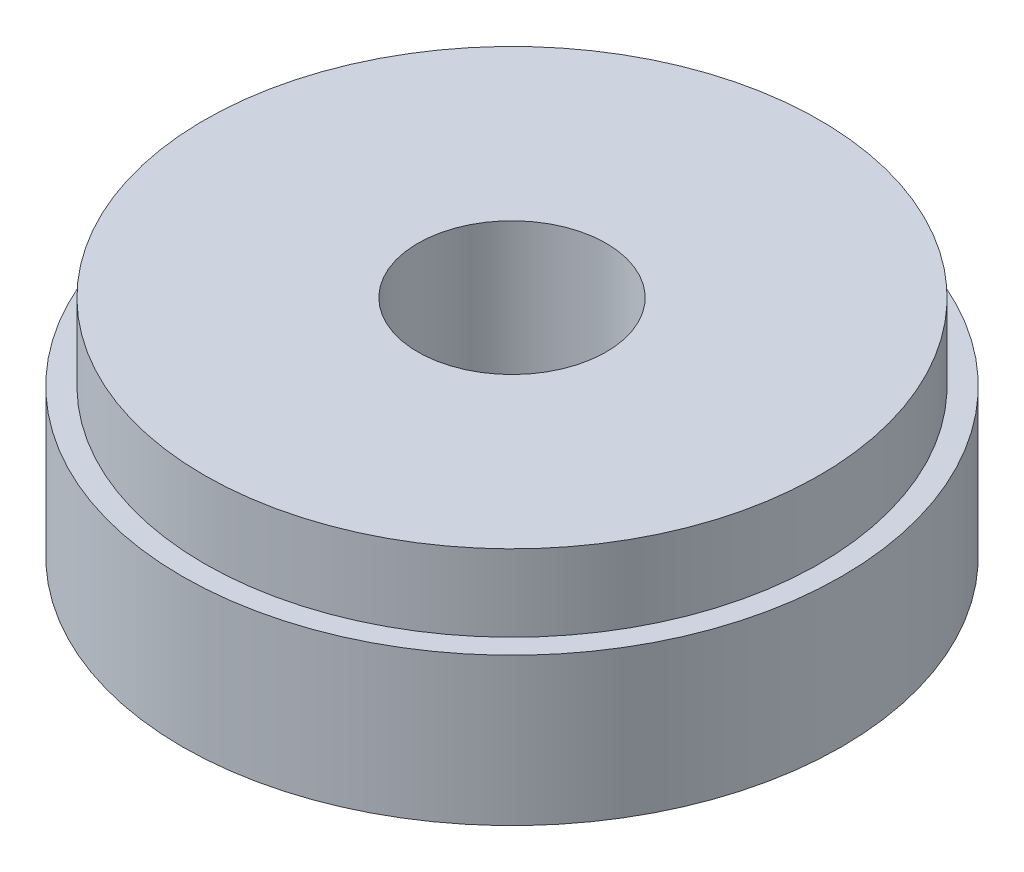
ISO-10303-21;
HEADER;
FILE_DESCRIPTION(('STEP AP214'),'2;1');
FILE_NAME('part.step','',(''),(''),'','','');
FILE_SCHEMA(('AUTOMOTIVE_DESIGN { 1 0 10303 214 1 1 1 1 }'));
ENDSEC;
DATA;
#1=APPLICATION_CONTEXT('core data for automotive mechanical design processes');
#2=APPLICATION_PROTOCOL_DEFINITION('international standard','automotive_design',2000,#1);
#3=PRODUCT_CONTEXT('',#1,'mechanical');
#4=PRODUCT('Part','Part','',(#3));
#5=PRODUCT_RELATED_PRODUCT_CATEGORY('part','',(#4));
#6=PRODUCT_DEFINITION_FORMATION('','',#4);
#7=PRODUCT_DEFINITION_CONTEXT('part definition',#1,'design');
#8=PRODUCT_DEFINITION('design','',#6,#7);
#9=PRODUCT_DEFINITION_SHAPE('','',#8);
#10=(LENGTH_UNIT() NAMED_UNIT(*) SI_UNIT(.MILLI.,.METRE.));
#11=(NAMED_UNIT(*) PLANE_ANGLE_UNIT() SI_UNIT($,.RADIAN.));
#12=(NAMED_UNIT(*) SI_UNIT($,.STERADIAN.) SOLID_ANGLE_UNIT());
#13=UNCERTAINTY_MEASURE_WITH_UNIT(LENGTH_MEASURE(1.E-05),#10,'distance_accuracy_value','');
#14=(GEOMETRIC_REPRESENTATION_CONTEXT(3) GLOBAL_UNCERTAINTY_ASSIGNED_CONTEXT((#13)) GLOBAL_UNIT_ASSIGNED_CONTEXT((#10,
#11,#12)) REPRESENTATION_CONTEXT('',''));
#15=CARTESIAN_POINT('',(0.,0.,0.));
#16=DIRECTION('',(0.,0.,1.));
#17=DIRECTION('',(1.,0.,0.));
#18=AXIS2_PLACEMENT_3D('',#15,#16,#17);
#19=CARTESIAN_POINT('',(0.,14.2748,0.));
#20=DIRECTION('',(0.,-1.,0.));
#21=DIRECTION('',(0.,0.,-1.));
#22=AXIS2_PLACEMENT_3D('',#19,#20,#21);
#23=CYLINDRICAL_SURFACE('',#22,21.);
#24=CARTESIAN_POINT('',(0.,0.,0.));
#25=DIRECTION('',(0.,1.,0.));
#26=DIRECTION('',(0.,0.,1.));
#27=AXIS2_PLACEMENT_3D('',#24,#25,#26);
#28=CIRCLE('',#27,21.);
#29=CARTESIAN_POINT('',(0.,0.,21.));
#30=VERTEX_POINT('',#29);
#31=EDGE_CURVE('E51',#30,#30,#28,.T.);
#32=ORIENTED_EDGE('',*,*,#31,.T.);
#33=EDGE_LOOP('',(#32));
#34=FACE_BOUND('',#33,.T.);
#35=CARTESIAN_POINT('',(0.,9.398,0.));
#36=DIRECTION('',(0.,1.,0.));
#37=DIRECTION('',(0.,0.,1.));
#38=AXIS2_PLACEMENT_3D('',#35,#36,#37);
#39=CIRCLE('',#38,21.);
#40=CARTESIAN_POINT('',(0.,9.398,21.));
#41=VERTEX_POINT('',#40);
#42=EDGE_CURVE('E46',#41,#41,#39,.T.);
#43=ORIENTED_EDGE('',*,*,#42,.F.);
#44=EDGE_LOOP('',(#43));
#45=FACE_BOUND('',#44,.T.);
#46=ADVANCED_FACE('F43',(#34,#45),#23,.T.);
#47=CARTESIAN_POINT('',(0.,14.2748,0.));
#48=DIRECTION('',(0.,1.,0.));
#49=DIRECTION('',(0.,0.,1.));
#50=AXIS2_PLACEMENT_3D('',#47,#48,#49);
#51=PLANE('',#50);
#52=CARTESIAN_POINT('',(0.,14.2748,0.));
#53=DIRECTION('',(0.,-1.,0.));
#54=DIRECTION('',(0.,0.,-1.));
#55=AXIS2_PLACEMENT_3D('',#52,#53,#54);
#56=CIRCLE('',#55,6.);
#57=CARTESIAN_POINT('',(0.,14.2748,-6.));
#58=VERTEX_POINT('',#57);
#59=EDGE_CURVE('E165',#58,#58,#56,.T.);
#60=ORIENTED_EDGE('',*,*,#59,.T.);
#61=EDGE_LOOP('',(#60));
#62=FACE_BOUND('',#61,.T.);
#63=CARTESIAN_POINT('',(0.,14.2748,0.));
#64=DIRECTION('',(0.,1.,0.));
#65=DIRECTION('',(0.,0.,1.));
#66=AXIS2_PLACEMENT_3D('',#63,#64,#65);
#67=CIRCLE('',#66,19.5961);
#68=CARTESIAN_POINT('',(0.,14.2748,19.5961));
#69=VERTEX_POINT('',#68);
#70=EDGE_CURVE('E108',#69,#69,#67,.T.);
#71=ORIENTED_EDGE('',*,*,#70,.T.);
#72=EDGE_LOOP('',(#71));
#73=FACE_BOUND('',#72,.T.);
#74=ADVANCED_FACE('F180',(#62,#73),#51,.T.);
#75=CARTESIAN_POINT('',(0.,0.,0.));
#76=DIRECTION('',(0.,1.,0.));
#77=DIRECTION('',(0.,0.,1.));
#78=AXIS2_PLACEMENT_3D('',#75,#76,#77);
#79=PLANE('',#78);
#80=CARTESIAN_POINT('',(12.5723585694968,0.,-12.5723585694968));
#81=DIRECTION('',(0.,-1.,0.));
#82=DIRECTION('',(0.,0.,-1.));
#83=AXIS2_PLACEMENT_3D('',#80,#81,#82);
#84=CIRCLE('',#83,1.13029999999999);
#85=CARTESIAN_POINT('',(12.5723585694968,0.,-13.7026585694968));
#86=VERTEX_POINT('',#85);
#87=EDGE_CURVE('E85',#86,#86,#84,.T.);
#88=ORIENTED_EDGE('',*,*,#87,.F.);
#89=EDGE_LOOP('',(#88));
#90=FACE_BOUND('',#89,.T.);
#91=CARTESIAN_POINT('',(-12.5723585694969,0.,-12.5723585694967));
#92=DIRECTION('',(0.,-1.,0.));
#93=DIRECTION('',(0.,0.,-1.));
#94=AXIS2_PLACEMENT_3D('',#91,#92,#93);
#95=CIRCLE('',#94,1.13029999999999);
#96=CARTESIAN_POINT('',(-12.5723585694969,0.,-13.7026585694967));
#97=VERTEX_POINT('',#96);
#98=EDGE_CURVE('E93',#97,#97,#95,.T.);
#99=ORIENTED_EDGE('',*,*,#98,.F.);
#100=EDGE_LOOP('',(#99));
#101=FACE_BOUND('',#100,.T.);
#102=CARTESIAN_POINT('',(-12.5723585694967,0.,12.5723585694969));
#103=DIRECTION('',(0.,-1.,0.));
#104=DIRECTION('',(0.,0.,-1.));
#105=AXIS2_PLACEMENT_3D('',#102,#103,#104);
#106=CIRCLE('',#105,1.13029999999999);
#107=CARTESIAN_POINT('',(-12.5723585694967,0.,11.4420585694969));
#108=VERTEX_POINT('',#107);
#109=EDGE_CURVE('E99',#108,#108,#106,.T.);
#110=ORIENTED_EDGE('',*,*,#109,.F.);
#111=EDGE_LOOP('',(#110));
#112=FACE_BOUND('',#111,.T.);
#113=CARTESIAN_POINT('',(12.572358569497,0.,12.5723585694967));
#114=DIRECTION('',(0.,-1.,0.));
#115=DIRECTION('',(0.,0.,-1.));
#116=AXIS2_PLACEMENT_3D('',#113,#114,#115);
#117=CIRCLE('',#116,1.13029999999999);
#118=CARTESIAN_POINT('',(12.572358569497,0.,11.4420585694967));
#119=VERTEX_POINT('',#118);
#120=EDGE_CURVE('E105',#119,#119,#117,.T.);
#121=ORIENTED_EDGE('',*,*,#120,.F.);
#122=EDGE_LOOP('',(#121));
#123=FACE_BOUND('',#122,.T.);
#124=CARTESIAN_POINT('',(1.83302876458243E-13,0.,-17.5));
#125=DIRECTION('',(0.,-1.,0.));
#126=DIRECTION('',(0.,0.,-1.));
#127=AXIS2_PLACEMENT_3D('',#124,#125,#126);
#128=CIRCLE('',#127,2.);
#129=CARTESIAN_POINT('',(1.83302876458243E-13,0.,-19.5));
#130=VERTEX_POINT('',#129);
#131=EDGE_CURVE('E123',#130,#130,#128,.T.);
#132=ORIENTED_EDGE('',*,*,#131,.F.);
#133=EDGE_LOOP('',(#132));
#134=FACE_BOUND('',#133,.T.);
#135=CARTESIAN_POINT('',(-17.5,0.,-1.22201917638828E-13));
#136=DIRECTION('',(0.,-1.,0.));
#137=DIRECTION('',(0.,0.,-1.));
#138=AXIS2_PLACEMENT_3D('',#135,#136,#137);
#139=CIRCLE('',#138,2.);
#140=CARTESIAN_POINT('',(-17.5,0.,-2.00000000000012));
#141=VERTEX_POINT('',#140);
#142=EDGE_CURVE('E135',#141,#141,#139,.T.);
#143=ORIENTED_EDGE('',*,*,#142,.F.);
#144=EDGE_LOOP('',(#143));
#145=FACE_BOUND('',#144,.T.);
#146=CARTESIAN_POINT('',(0.,0.,17.5));
#147=DIRECTION('',(0.,-1.,0.));
#148=DIRECTION('',(0.,0.,-1.));
#149=AXIS2_PLACEMENT_3D('',#146,#147,#148);
#150=CIRCLE('',#149,2.);
#151=CARTESIAN_POINT('',(0.,0.,15.5));
#152=VERTEX_POINT('',#151);
#153=EDGE_CURVE('E147',#152,#152,#150,.T.);
#154=ORIENTED_EDGE('',*,*,#153,.F.);
#155=EDGE_LOOP('',(#154));
#156=FACE_BOUND('',#155,.T.);
#157=CARTESIAN_POINT('',(17.5,0.,0.));
#158=DIRECTION('',(0.,-1.,0.));
#159=DIRECTION('',(0.,0.,-1.));
#160=AXIS2_PLACEMENT_3D('',#157,#158,#159);
#161=CIRCLE('',#160,2.);
#162=CARTESIAN_POINT('',(17.5,0.,-2.));
#163=VERTEX_POINT('',#162);
#164=EDGE_CURVE('E159',#163,#163,#161,.T.);
#165=ORIENTED_EDGE('',*,*,#164,.F.);
#166=EDGE_LOOP('',(#165));
#167=FACE_BOUND('',#166,.T.);
#168=ORIENTED_EDGE('',*,*,#31,.F.);
#169=EDGE_LOOP('',(#168));
#170=FACE_BOUND('',#169,.T.);
#171=CARTESIAN_POINT('',(0.,0.,0.));
#172=DIRECTION('',(0.,1.,0.));
#173=DIRECTION('',(0.,0.,1.));
#174=AXIS2_PLACEMENT_3D('',#171,#172,#173);
#175=CIRCLE('',#174,14.);
#176=CARTESIAN_POINT('',(0.,0.,14.));
#177=VERTEX_POINT('',#176);
#178=EDGE_CURVE('E12',#177,#177,#175,.F.);
#179=ORIENTED_EDGE('',*,*,#178,.F.);
#180=EDGE_LOOP('',(#179));
#181=FACE_BOUND('',#180,.T.);
#182=ADVANCED_FACE('F176',(#90,#101,#112,#123,#134,#145,#156,#167,#170,#181),#79,.F.);
#183=CARTESIAN_POINT('',(0.,-3.,0.));
#184=DIRECTION('',(0.,1.,0.));
#185=DIRECTION('',(0.,0.,1.));
#186=AXIS2_PLACEMENT_3D('',#183,#184,#185);
#187=CYLINDRICAL_SURFACE('',#186,14.);
#188=CARTESIAN_POINT('',(0.,-3.,0.));
#189=DIRECTION('',(0.,-1.,0.));
#190=DIRECTION('',(0.,0.,-1.));
#191=AXIS2_PLACEMENT_3D('',#188,#189,#190);
#192=CIRCLE('',#191,14.);
#193=CARTESIAN_POINT('',(0.,-3.,-14.));
#194=VERTEX_POINT('',#193);
#195=EDGE_CURVE('E168',#194,#194,#192,.T.);
#196=ORIENTED_EDGE('',*,*,#195,.F.);
#197=EDGE_LOOP('',(#196));
#198=FACE_BOUND('',#197,.T.);
#199=ORIENTED_EDGE('',*,*,#178,.T.);
#200=EDGE_LOOP('',(#199));
#201=FACE_BOUND('',#200,.T.);
#202=ADVANCED_FACE('F179',(#198,#201),#187,.T.);
#203=CARTESIAN_POINT('',(0.,-3.,0.));
#204=DIRECTION('',(0.,-1.,0.));
#205=DIRECTION('',(0.,0.,-1.));
#206=AXIS2_PLACEMENT_3D('',#203,#204,#205);
#207=PLANE('',#206);
#208=CARTESIAN_POINT('',(0.,-3.,0.));
#209=DIRECTION('',(0.,-1.,0.));
#210=DIRECTION('',(0.,0.,-1.));
#211=AXIS2_PLACEMENT_3D('',#208,#209,#210);
#212=CIRCLE('',#211,6.);
#213=CARTESIAN_POINT('',(0.,-3.,-6.));
#214=VERTEX_POINT('',#213);
#215=EDGE_CURVE('E162',#214,#214,#212,.T.);
#216=ORIENTED_EDGE('',*,*,#215,.F.);
#217=EDGE_LOOP('',(#216));
#218=FACE_BOUND('',#217,.T.);
#219=ORIENTED_EDGE('',*,*,#195,.T.);
#220=EDGE_LOOP('',(#219));
#221=FACE_BOUND('',#220,.T.);
#222=ADVANCED_FACE('F186',(#218,#221),#207,.T.);
#223=CARTESIAN_POINT('',(0.,14.2748,0.));
#224=DIRECTION('',(0.,-1.,0.));
#225=DIRECTION('',(0.,0.,-1.));
#226=AXIS2_PLACEMENT_3D('',#223,#224,#225);
#227=CYLINDRICAL_SURFACE('',#226,6.);
#228=ORIENTED_EDGE('',*,*,#59,.F.);
#229=EDGE_LOOP('',(#228));
#230=FACE_BOUND('',#229,.T.);
#231=ORIENTED_EDGE('',*,*,#215,.T.);
#232=EDGE_LOOP('',(#231));
#233=FACE_BOUND('',#232,.T.);
#234=ADVANCED_FACE('F192',(#230,#233),#227,.F.);
#235=CARTESIAN_POINT('',(17.5,0.,0.));
#236=DIRECTION('',(0.,-1.,0.));
#237=DIRECTION('',(0.,0.,-1.));
#238=AXIS2_PLACEMENT_3D('',#235,#236,#237);
#239=CYLINDRICAL_SURFACE('',#238,2.);
#240=CARTESIAN_POINT('',(17.5,8.,0.));
#241=DIRECTION('',(0.,-1.,0.));
#242=DIRECTION('',(0.,0.,-1.));
#243=AXIS2_PLACEMENT_3D('',#240,#241,#242);
#244=CIRCLE('',#243,2.);
#245=CARTESIAN_POINT('',(17.5,8.,-2.));
#246=VERTEX_POINT('',#245);
#247=EDGE_CURVE('E156',#246,#246,#244,.T.);
#248=ORIENTED_EDGE('',*,*,#247,.F.);
#249=EDGE_LOOP('',(#248));
#250=FACE_BOUND('',#249,.T.);
#251=ORIENTED_EDGE('',*,*,#164,.T.);
#252=EDGE_LOOP('',(#251));
#253=FACE_BOUND('',#252,.T.);
#254=ADVANCED_FACE('F281',(#250,#253),#239,.F.);
#255=CARTESIAN_POINT('',(19.15,8.,0.));
#256=DIRECTION('',(0.,1.,0.));
#257=DIRECTION('',(0.,0.,1.));
#258=AXIS2_PLACEMENT_3D('',#255,#256,#257);
#259=PLANE('',#258);
#260=CARTESIAN_POINT('',(17.5,8.,0.));
#261=DIRECTION('',(0.,-1.,0.));
#262=DIRECTION('',(0.,0.,-1.));
#263=AXIS2_PLACEMENT_3D('',#260,#261,#262);
#264=CIRCLE('',#263,1.65);
#265=CARTESIAN_POINT('',(17.5,8.,-1.65));
#266=VERTEX_POINT('',#265);
#267=EDGE_CURVE('E153',#266,#266,#264,.T.);
#268=ORIENTED_EDGE('',*,*,#267,.F.);
#269=EDGE_LOOP('',(#268));
#270=FACE_BOUND('',#269,.T.);
#271=ORIENTED_EDGE('',*,*,#247,.T.);
#272=EDGE_LOOP('',(#271));
#273=FACE_BOUND('',#272,.T.);
#274=ADVANCED_FACE('F277',(#270,#273),#259,.F.);
#275=CARTESIAN_POINT('',(17.5,0.,0.));
#276=DIRECTION('',(0.,-1.,0.));
#277=DIRECTION('',(0.,0.,-1.));
#278=AXIS2_PLACEMENT_3D('',#275,#276,#277);
#279=CYLINDRICAL_SURFACE('',#278,1.65);
#280=CARTESIAN_POINT('',(17.5,10.1,0.));
#281=DIRECTION('',(0.,-1.,0.));
#282=DIRECTION('',(0.,0.,-1.));
#283=AXIS2_PLACEMENT_3D('',#280,#281,#282);
#284=CIRCLE('',#283,1.65);
#285=CARTESIAN_POINT('',(17.5,10.1,-1.65));
#286=VERTEX_POINT('',#285);
#287=EDGE_CURVE('E150',#286,#286,#284,.T.);
#288=ORIENTED_EDGE('',*,*,#287,.F.);
#289=EDGE_LOOP('',(#288));
#290=FACE_BOUND('',#289,.T.);
#291=ORIENTED_EDGE('',*,*,#267,.T.);
#292=EDGE_LOOP('',(#291));
#293=FACE_BOUND('',#292,.T.);
#294=ADVANCED_FACE('F274',(#290,#293),#279,.F.);
#295=CARTESIAN_POINT('',(17.5,10.1,0.));
#296=DIRECTION('',(0.,-1.,0.));
#297=DIRECTION('',(0.,0.,-1.));
#298=AXIS2_PLACEMENT_3D('',#295,#296,#297);
#299=CONICAL_SURFACE('',#298,1.65,1.02974425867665);
#300=CARTESIAN_POINT('',(17.5,11.0914200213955,0.));
#301=VERTEX_POINT('',#300);
#302=VERTEX_LOOP('',#301);
#303=FACE_BOUND('',#302,.T.);
#304=ORIENTED_EDGE('',*,*,#287,.T.);
#305=EDGE_LOOP('',(#304));
#306=FACE_BOUND('',#305,.T.);
#307=ADVANCED_FACE('F270',(#303,#306),#299,.F.);
#308=CARTESIAN_POINT('',(0.,0.,17.5));
#309=DIRECTION('',(0.,-1.,0.));
#310=DIRECTION('',(0.,0.,-1.));
#311=AXIS2_PLACEMENT_3D('',#308,#309,#310);
#312=CYLINDRICAL_SURFACE('',#311,2.);
#313=CARTESIAN_POINT('',(0.,8.,17.5));
#314=DIRECTION('',(0.,-1.,0.));
#315=DIRECTION('',(0.,0.,-1.));
#316=AXIS2_PLACEMENT_3D('',#313,#314,#315);
#317=CIRCLE('',#316,2.);
#318=CARTESIAN_POINT('',(0.,8.,15.5));
#319=VERTEX_POINT('',#318);
#320=EDGE_CURVE('E144',#319,#319,#317,.T.);
#321=ORIENTED_EDGE('',*,*,#320,.F.);
#322=EDGE_LOOP('',(#321));
#323=FACE_BOUND('',#322,.T.);
#324=ORIENTED_EDGE('',*,*,#153,.T.);
#325=EDGE_LOOP('',(#324));
#326=FACE_BOUND('',#325,.T.);
#327=ADVANCED_FACE('F266',(#323,#326),#312,.F.);
#328=CARTESIAN_POINT('',(1.64999999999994,8.,17.5));
#329=DIRECTION('',(0.,1.,0.));
#330=DIRECTION('',(0.,0.,1.));
#331=AXIS2_PLACEMENT_3D('',#328,#329,#330);
#332=PLANE('',#331);
#333=CARTESIAN_POINT('',(0.,8.,17.5));
#334=DIRECTION('',(0.,-1.,0.));
#335=DIRECTION('',(0.,0.,-1.));
#336=AXIS2_PLACEMENT_3D('',#333,#334,#335);
#337=CIRCLE('',#336,1.65);
#338=CARTESIAN_POINT('',(0.,8.,15.85));
#339=VERTEX_POINT('',#338);
#340=EDGE_CURVE('E141',#339,#339,#337,.T.);
#341=ORIENTED_EDGE('',*,*,#340,.F.);
#342=EDGE_LOOP('',(#341));
#343=FACE_BOUND('',#342,.T.);
#344=ORIENTED_EDGE('',*,*,#320,.T.);
#345=EDGE_LOOP('',(#344));
#346=FACE_BOUND('',#345,.T.);
#347=ADVANCED_FACE('F262',(#343,#346),#332,.F.);
#348=CARTESIAN_POINT('',(0.,0.,17.5));
#349=DIRECTION('',(0.,-1.,0.));
#350=DIRECTION('',(0.,0.,-1.));
#351=AXIS2_PLACEMENT_3D('',#348,#349,#350);
#352=CYLINDRICAL_SURFACE('',#351,1.65);
#353=CARTESIAN_POINT('',(0.,10.1,17.5));
#354=DIRECTION('',(0.,-1.,0.));
#355=DIRECTION('',(0.,0.,-1.));
#356=AXIS2_PLACEMENT_3D('',#353,#354,#355);
#357=CIRCLE('',#356,1.65);
#358=CARTESIAN_POINT('',(0.,10.1,15.85));
#359=VERTEX_POINT('',#358);
#360=EDGE_CURVE('E138',#359,#359,#357,.T.);
#361=ORIENTED_EDGE('',*,*,#360,.F.);
#362=EDGE_LOOP('',(#361));
#363=FACE_BOUND('',#362,.T.);
#364=ORIENTED_EDGE('',*,*,#340,.T.);
#365=EDGE_LOOP('',(#364));
#366=FACE_BOUND('',#365,.T.);
#367=ADVANCED_FACE('F259',(#363,#366),#352,.F.);
#368=CARTESIAN_POINT('',(0.,10.1,17.5));
#369=DIRECTION('',(0.,-1.,0.));
#370=DIRECTION('',(0.,0.,-1.));
#371=AXIS2_PLACEMENT_3D('',#368,#369,#370);
#372=CONICAL_SURFACE('',#371,1.65,1.02974425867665);
#373=CARTESIAN_POINT('',(0.,11.0914200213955,17.5));
#374=VERTEX_POINT('',#373);
#375=VERTEX_LOOP('',#374);
#376=FACE_BOUND('',#375,.T.);
#377=ORIENTED_EDGE('',*,*,#360,.T.);
#378=EDGE_LOOP('',(#377));
#379=FACE_BOUND('',#378,.T.);
#380=ADVANCED_FACE('F255',(#376,#379),#372,.F.);
#381=CARTESIAN_POINT('',(-17.5,0.,-1.22201917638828E-13));
#382=DIRECTION('',(0.,-1.,0.));
#383=DIRECTION('',(0.,0.,-1.));
#384=AXIS2_PLACEMENT_3D('',#381,#382,#383);
#385=CYLINDRICAL_SURFACE('',#384,2.);
#386=CARTESIAN_POINT('',(-17.5,8.,-1.22201917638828E-13));
#387=DIRECTION('',(0.,-1.,0.));
#388=DIRECTION('',(0.,0.,-1.));
#389=AXIS2_PLACEMENT_3D('',#386,#387,#388);
#390=CIRCLE('',#389,2.);
#391=CARTESIAN_POINT('',(-17.5,8.,-2.00000000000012));
#392=VERTEX_POINT('',#391);
#393=EDGE_CURVE('E132',#392,#392,#390,.T.);
#394=ORIENTED_EDGE('',*,*,#393,.F.);
#395=EDGE_LOOP('',(#394));
#396=FACE_BOUND('',#395,.T.);
#397=ORIENTED_EDGE('',*,*,#142,.T.);
#398=EDGE_LOOP('',(#397));
#399=FACE_BOUND('',#398,.T.);
#400=ADVANCED_FACE('F251',(#396,#399),#385,.F.);
#401=CARTESIAN_POINT('',(-15.85,8.,-1.22201917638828E-13));
#402=DIRECTION('',(0.,1.,0.));
#403=DIRECTION('',(0.,0.,1.));
#404=AXIS2_PLACEMENT_3D('',#401,#402,#403);
#405=PLANE('',#404);
#406=CARTESIAN_POINT('',(-17.5,8.,-1.22201917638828E-13));
#407=DIRECTION('',(0.,-1.,0.));
#408=DIRECTION('',(0.,0.,-1.));
#409=AXIS2_PLACEMENT_3D('',#406,#407,#408);
#410=CIRCLE('',#409,1.65);
#411=CARTESIAN_POINT('',(-17.5,8.,-1.65000000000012));
#412=VERTEX_POINT('',#411);
#413=EDGE_CURVE('E129',#412,#412,#410,.T.);
#414=ORIENTED_EDGE('',*,*,#413,.F.);
#415=EDGE_LOOP('',(#414));
#416=FACE_BOUND('',#415,.T.);
#417=ORIENTED_EDGE('',*,*,#393,.T.);
#418=EDGE_LOOP('',(#417));
#419=FACE_BOUND('',#418,.T.);
#420=ADVANCED_FACE('F247',(#416,#419),#405,.F.);
#421=CARTESIAN_POINT('',(-17.5,0.,-1.22201917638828E-13));
#422=DIRECTION('',(0.,-1.,0.));
#423=DIRECTION('',(0.,0.,-1.));
#424=AXIS2_PLACEMENT_3D('',#421,#422,#423);
#425=CYLINDRICAL_SURFACE('',#424,1.65);
#426=CARTESIAN_POINT('',(-17.5,10.1,-1.22201917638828E-13));
#427=DIRECTION('',(0.,-1.,0.));
#428=DIRECTION('',(0.,0.,-1.));
#429=AXIS2_PLACEMENT_3D('',#426,#427,#428);
#430=CIRCLE('',#429,1.65);
#431=CARTESIAN_POINT('',(-17.5,10.1,-1.65000000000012));
#432=VERTEX_POINT('',#431);
#433=EDGE_CURVE('E126',#432,#432,#430,.T.);
#434=ORIENTED_EDGE('',*,*,#433,.F.);
#435=EDGE_LOOP('',(#434));
#436=FACE_BOUND('',#435,.T.);
#437=ORIENTED_EDGE('',*,*,#413,.T.);
#438=EDGE_LOOP('',(#437));
#439=FACE_BOUND('',#438,.T.);
#440=ADVANCED_FACE('F243',(#436,#439),#425,.F.);
#441=CARTESIAN_POINT('',(-17.5,10.1,-1.22201917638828E-13));
#442=DIRECTION('',(0.,-1.,0.));
#443=DIRECTION('',(0.,0.,-1.));
#444=AXIS2_PLACEMENT_3D('',#441,#442,#443);
#445=CONICAL_SURFACE('',#444,1.65,1.02974425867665);
#446=CARTESIAN_POINT('',(-17.5,11.0914200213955,-1.22201917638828E-13));
#447=VERTEX_POINT('',#446);
#448=VERTEX_LOOP('',#447);
#449=FACE_BOUND('',#448,.T.);
#450=ORIENTED_EDGE('',*,*,#433,.T.);
#451=EDGE_LOOP('',(#450));
#452=FACE_BOUND('',#451,.T.);
#453=ADVANCED_FACE('F239',(#449,#452),#445,.F.);
#454=CARTESIAN_POINT('',(1.83302876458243E-13,0.,-17.5));
#455=DIRECTION('',(0.,-1.,0.));
#456=DIRECTION('',(0.,0.,-1.));
#457=AXIS2_PLACEMENT_3D('',#454,#455,#456);
#458=CYLINDRICAL_SURFACE('',#457,2.);
#459=CARTESIAN_POINT('',(1.83302876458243E-13,8.,-17.5));
#460=DIRECTION('',(0.,-1.,0.));
#461=DIRECTION('',(0.,0.,-1.));
#462=AXIS2_PLACEMENT_3D('',#459,#460,#461);
#463=CIRCLE('',#462,2.);
#464=CARTESIAN_POINT('',(1.83302876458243E-13,8.,-19.5));
#465=VERTEX_POINT('',#464);
#466=EDGE_CURVE('E120',#465,#465,#463,.T.);
#467=ORIENTED_EDGE('',*,*,#466,.F.);
#468=EDGE_LOOP('',(#467));
#469=FACE_BOUND('',#468,.T.);
#470=ORIENTED_EDGE('',*,*,#131,.T.);
#471=EDGE_LOOP('',(#470));
#472=FACE_BOUND('',#471,.T.);
#473=ADVANCED_FACE('F235',(#469,#472),#458,.F.);
#474=CARTESIAN_POINT('',(1.65000000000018,8.,-17.5));
#475=DIRECTION('',(0.,1.,0.));
#476=DIRECTION('',(0.,0.,1.));
#477=AXIS2_PLACEMENT_3D('',#474,#475,#476);
#478=PLANE('',#477);
#479=CARTESIAN_POINT('',(1.83302876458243E-13,8.,-17.5));
#480=DIRECTION('',(0.,-1.,0.));
#481=DIRECTION('',(0.,0.,-1.));
#482=AXIS2_PLACEMENT_3D('',#479,#480,#481);
#483=CIRCLE('',#482,1.65);
#484=CARTESIAN_POINT('',(1.83302876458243E-13,8.,-19.15));
#485=VERTEX_POINT('',#484);
#486=EDGE_CURVE('E117',#485,#485,#483,.T.);
#487=ORIENTED_EDGE('',*,*,#486,.F.);
#488=EDGE_LOOP('',(#487));
#489=FACE_BOUND('',#488,.T.);
#490=ORIENTED_EDGE('',*,*,#466,.T.);
#491=EDGE_LOOP('',(#490));
#492=FACE_BOUND('',#491,.T.);
#493=ADVANCED_FACE('F231',(#489,#492),#478,.F.);
#494=CARTESIAN_POINT('',(1.83302876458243E-13,0.,-17.5));
#495=DIRECTION('',(0.,-1.,0.));
#496=DIRECTION('',(0.,0.,-1.));
#497=AXIS2_PLACEMENT_3D('',#494,#495,#496);
#498=CYLINDRICAL_SURFACE('',#497,1.65);
#499=CARTESIAN_POINT('',(1.83302876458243E-13,10.1,-17.5));
#500=DIRECTION('',(0.,-1.,0.));
#501=DIRECTION('',(0.,0.,-1.));
#502=AXIS2_PLACEMENT_3D('',#499,#500,#501);
#503=CIRCLE('',#502,1.65);
#504=CARTESIAN_POINT('',(1.83302876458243E-13,10.1,-19.15));
#505=VERTEX_POINT('',#504);
#506=EDGE_CURVE('E114',#505,#505,#503,.T.);
#507=ORIENTED_EDGE('',*,*,#506,.F.);
#508=EDGE_LOOP('',(#507));
#509=FACE_BOUND('',#508,.T.);
#510=ORIENTED_EDGE('',*,*,#486,.T.);
#511=EDGE_LOOP('',(#510));
#512=FACE_BOUND('',#511,.T.);
#513=ADVANCED_FACE('F227',(#509,#512),#498,.F.);
#514=CARTESIAN_POINT('',(1.83302876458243E-13,10.1,-17.5));
#515=DIRECTION('',(0.,-1.,0.));
#516=DIRECTION('',(0.,0.,-1.));
#517=AXIS2_PLACEMENT_3D('',#514,#515,#516);
#518=CONICAL_SURFACE('',#517,1.65,1.02974425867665);
#519=CARTESIAN_POINT('',(1.8058635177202E-13,11.0914200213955,-17.5));
#520=VERTEX_POINT('',#519);
#521=VERTEX_LOOP('',#520);
#522=FACE_BOUND('',#521,.T.);
#523=ORIENTED_EDGE('',*,*,#506,.T.);
#524=EDGE_LOOP('',(#523));
#525=FACE_BOUND('',#524,.T.);
#526=ADVANCED_FACE('F220',(#522,#525),#518,.F.);
#527=CARTESIAN_POINT('',(0.,9.398,0.));
#528=DIRECTION('',(0.,1.,0.));
#529=DIRECTION('',(0.,0.,1.));
#530=AXIS2_PLACEMENT_3D('',#527,#528,#529);
#531=PLANE('',#530);
#532=CARTESIAN_POINT('',(0.,9.398,0.));
#533=DIRECTION('',(0.,1.,0.));
#534=DIRECTION('',(0.,0.,1.));
#535=AXIS2_PLACEMENT_3D('',#532,#533,#534);
#536=CIRCLE('',#535,19.5961);
#537=CARTESIAN_POINT('',(0.,9.398,19.5961));
#538=VERTEX_POINT('',#537);
#539=EDGE_CURVE('E111',#538,#538,#536,.T.);
#540=ORIENTED_EDGE('',*,*,#539,.F.);
#541=EDGE_LOOP('',(#540));
#542=FACE_BOUND('',#541,.T.);
#543=ORIENTED_EDGE('',*,*,#42,.T.);
#544=EDGE_LOOP('',(#543));
#545=FACE_BOUND('',#544,.T.);
#546=ADVANCED_FACE('F210',(#542,#545),#531,.T.);
#547=CARTESIAN_POINT('',(0.,9.398,0.));
#548=DIRECTION('',(0.,1.,0.));
#549=DIRECTION('',(0.,0.,1.));
#550=AXIS2_PLACEMENT_3D('',#547,#548,#549);
#551=CYLINDRICAL_SURFACE('',#550,19.5961);
#552=ORIENTED_EDGE('',*,*,#539,.T.);
#553=EDGE_LOOP('',(#552));
#554=FACE_BOUND('',#553,.T.);
#555=ORIENTED_EDGE('',*,*,#70,.F.);
#556=EDGE_LOOP('',(#555));
#557=FACE_BOUND('',#556,.T.);
#558=ADVANCED_FACE('F207',(#554,#557),#551,.T.);
#559=CARTESIAN_POINT('',(12.572358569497,0.,12.5723585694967));
#560=DIRECTION('',(0.,-1.,0.));
#561=DIRECTION('',(0.,0.,-1.));
#562=AXIS2_PLACEMENT_3D('',#559,#560,#561);
#563=CYLINDRICAL_SURFACE('',#562,1.13029999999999);
#564=CARTESIAN_POINT('',(12.572358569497,7.59459999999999,12.5723585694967));
#565=DIRECTION('',(0.,-1.,0.));
#566=DIRECTION('',(0.,0.,-1.));
#567=AXIS2_PLACEMENT_3D('',#564,#565,#566);
#568=CIRCLE('',#567,1.13029999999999);
#569=CARTESIAN_POINT('',(12.572358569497,7.59459999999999,11.4420585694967));
#570=VERTEX_POINT('',#569);
#571=EDGE_CURVE('E102',#570,#570,#568,.T.);
#572=ORIENTED_EDGE('',*,*,#571,.F.);
#573=EDGE_LOOP('',(#572));
#574=FACE_BOUND('',#573,.T.);
#575=ORIENTED_EDGE('',*,*,#120,.T.);
#576=EDGE_LOOP('',(#575));
#577=FACE_BOUND('',#576,.T.);
#578=ADVANCED_FACE('F209',(#574,#577),#563,.F.);
#579=CARTESIAN_POINT('',(12.572358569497,7.59459999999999,12.5723585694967));
#580=DIRECTION('',(0.,-1.,0.));
#581=DIRECTION('',(0.,0.,-1.));
#582=AXIS2_PLACEMENT_3D('',#579,#580,#581);
#583=CONICAL_SURFACE('',#582,1.13029999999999,1.02974425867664);
#584=CARTESIAN_POINT('',(12.572358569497,8.27375275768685,12.5723585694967));
#585=VERTEX_POINT('',#584);
#586=VERTEX_LOOP('',#585);
#587=FACE_BOUND('',#586,.T.);
#588=ORIENTED_EDGE('',*,*,#571,.T.);
#589=EDGE_LOOP('',(#588));
#590=FACE_BOUND('',#589,.T.);
#591=ADVANCED_FACE('F217',(#587,#590),#583,.F.);
#592=CARTESIAN_POINT('',(-12.5723585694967,0.,12.5723585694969));
#593=DIRECTION('',(0.,-1.,0.));
#594=DIRECTION('',(0.,0.,-1.));
#595=AXIS2_PLACEMENT_3D('',#592,#593,#594);
#596=CYLINDRICAL_SURFACE('',#595,1.13029999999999);
#597=CARTESIAN_POINT('',(-12.5723585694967,7.59459999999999,12.5723585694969));
#598=DIRECTION('',(0.,-1.,0.));
#599=DIRECTION('',(0.,0.,-1.));
#600=AXIS2_PLACEMENT_3D('',#597,#598,#599);
#601=CIRCLE('',#600,1.13029999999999);
#602=CARTESIAN_POINT('',(-12.5723585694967,7.59459999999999,11.4420585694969));
#603=VERTEX_POINT('',#602);
#604=EDGE_CURVE('E96',#603,#603,#601,.T.);
#605=ORIENTED_EDGE('',*,*,#604,.F.);
#606=EDGE_LOOP('',(#605));
#607=FACE_BOUND('',#606,.T.);
#608=ORIENTED_EDGE('',*,*,#109,.T.);
#609=EDGE_LOOP('',(#608));
#610=FACE_BOUND('',#609,.T.);
#611=ADVANCED_FACE('F396',(#607,#610),#596,.F.);
#612=CARTESIAN_POINT('',(-12.5723585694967,7.59459999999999,12.5723585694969));
#613=DIRECTION('',(0.,-1.,0.));
#614=DIRECTION('',(0.,0.,-1.));
#615=AXIS2_PLACEMENT_3D('',#612,#613,#614);
#616=CONICAL_SURFACE('',#615,1.13029999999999,1.02974425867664);
#617=CARTESIAN_POINT('',(-12.5723585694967,8.27375275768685,12.5723585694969));
#618=VERTEX_POINT('',#617);
#619=VERTEX_LOOP('',#618);
#620=FACE_BOUND('',#619,.T.);
#621=ORIENTED_EDGE('',*,*,#604,.T.);
#622=EDGE_LOOP('',(#621));
#623=FACE_BOUND('',#622,.T.);
#624=ADVANCED_FACE('F405',(#620,#623),#616,.F.);
#625=CARTESIAN_POINT('',(-12.5723585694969,0.,-12.5723585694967));
#626=DIRECTION('',(0.,-1.,0.));
#627=DIRECTION('',(0.,0.,-1.));
#628=AXIS2_PLACEMENT_3D('',#625,#626,#627);
#629=CYLINDRICAL_SURFACE('',#628,1.13029999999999);
#630=CARTESIAN_POINT('',(-12.5723585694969,7.59459999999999,-12.5723585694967));
#631=DIRECTION('',(0.,-1.,0.));
#632=DIRECTION('',(0.,0.,-1.));
#633=AXIS2_PLACEMENT_3D('',#630,#631,#632);
#634=CIRCLE('',#633,1.13029999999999);
#635=CARTESIAN_POINT('',(-12.5723585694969,7.59459999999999,-13.7026585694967));
#636=VERTEX_POINT('',#635);
#637=EDGE_CURVE('E88',#636,#636,#634,.T.);
#638=ORIENTED_EDGE('',*,*,#637,.F.);
#639=EDGE_LOOP('',(#638));
#640=FACE_BOUND('',#639,.T.);
#641=ORIENTED_EDGE('',*,*,#98,.T.);
#642=EDGE_LOOP('',(#641));
#643=FACE_BOUND('',#642,.T.);
#644=ADVANCED_FACE('F417',(#640,#643),#629,.F.);
#645=CARTESIAN_POINT('',(-12.5723585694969,7.59459999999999,-12.5723585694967));
#646=DIRECTION('',(0.,-1.,0.));
#647=DIRECTION('',(0.,0.,-1.));
#648=AXIS2_PLACEMENT_3D('',#645,#646,#647);
#649=CONICAL_SURFACE('',#648,1.13029999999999,1.02974425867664);
#650=CARTESIAN_POINT('',(-12.5723585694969,8.27375275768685,-12.5723585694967));
#651=VERTEX_POINT('',#650);
#652=VERTEX_LOOP('',#651);
#653=FACE_BOUND('',#652,.T.);
#654=ORIENTED_EDGE('',*,*,#637,.T.);
#655=EDGE_LOOP('',(#654));
#656=FACE_BOUND('',#655,.T.);
#657=ADVANCED_FACE('F427',(#653,#656),#649,.F.);
#658=CARTESIAN_POINT('',(12.5723585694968,0.,-12.5723585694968));
#659=DIRECTION('',(0.,-1.,0.));
#660=DIRECTION('',(0.,0.,-1.));
#661=AXIS2_PLACEMENT_3D('',#658,#659,#660);
#662=CYLINDRICAL_SURFACE('',#661,1.13029999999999);
#663=CARTESIAN_POINT('',(12.5723585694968,7.59459999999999,-12.5723585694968));
#664=DIRECTION('',(0.,-1.,0.));
#665=DIRECTION('',(0.,0.,-1.));
#666=AXIS2_PLACEMENT_3D('',#663,#664,#665);
#667=CIRCLE('',#666,1.13029999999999);
#668=CARTESIAN_POINT('',(12.5723585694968,7.59459999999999,-13.7026585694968));
#669=VERTEX_POINT('',#668);
#670=EDGE_CURVE('E83',#669,#669,#667,.T.);
#671=ORIENTED_EDGE('',*,*,#670,.F.);
#672=EDGE_LOOP('',(#671));
#673=FACE_BOUND('',#672,.T.);
#674=ORIENTED_EDGE('',*,*,#87,.T.);
#675=EDGE_LOOP('',(#674));
#676=FACE_BOUND('',#675,.T.);
#677=ADVANCED_FACE('F79',(#673,#676),#662,.F.);
#678=CARTESIAN_POINT('',(12.5723585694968,7.59459999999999,-12.5723585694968));
#679=DIRECTION('',(0.,-1.,0.));
#680=DIRECTION('',(0.,0.,-1.));
#681=AXIS2_PLACEMENT_3D('',#678,#679,#680);
#682=CONICAL_SURFACE('',#681,1.13029999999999,1.02974425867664);
#683=CARTESIAN_POINT('',(12.5723585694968,8.27375275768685,-12.5723585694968));
#684=VERTEX_POINT('',#683);
#685=VERTEX_LOOP('',#684);
#686=FACE_BOUND('',#685,.T.);
#687=ORIENTED_EDGE('',*,*,#670,.T.);
#688=EDGE_LOOP('',(#687));
#689=FACE_BOUND('',#688,.T.);
#690=ADVANCED_FACE('F76',(#686,#689),#682,.F.);
#691=CLOSED_SHELL('',(#46,#74,#182,#202,#222,#234,#254,#274,#294,#307,#327,#347,#367,#380,#400,
#420,#440,#453,#473,#493,#513,#526,#546,#558,#578,#591,#611,#624,#644,#657,#677,#690));
#692=MANIFOLD_SOLID_BREP('B2',#691);
#693=ADVANCED_BREP_SHAPE_REPRESENTATION('',(#18,#692),#14);
#694=SHAPE_DEFINITION_REPRESENTATION(#9,#693);
ENDSEC;
END-ISO-10303-21;
